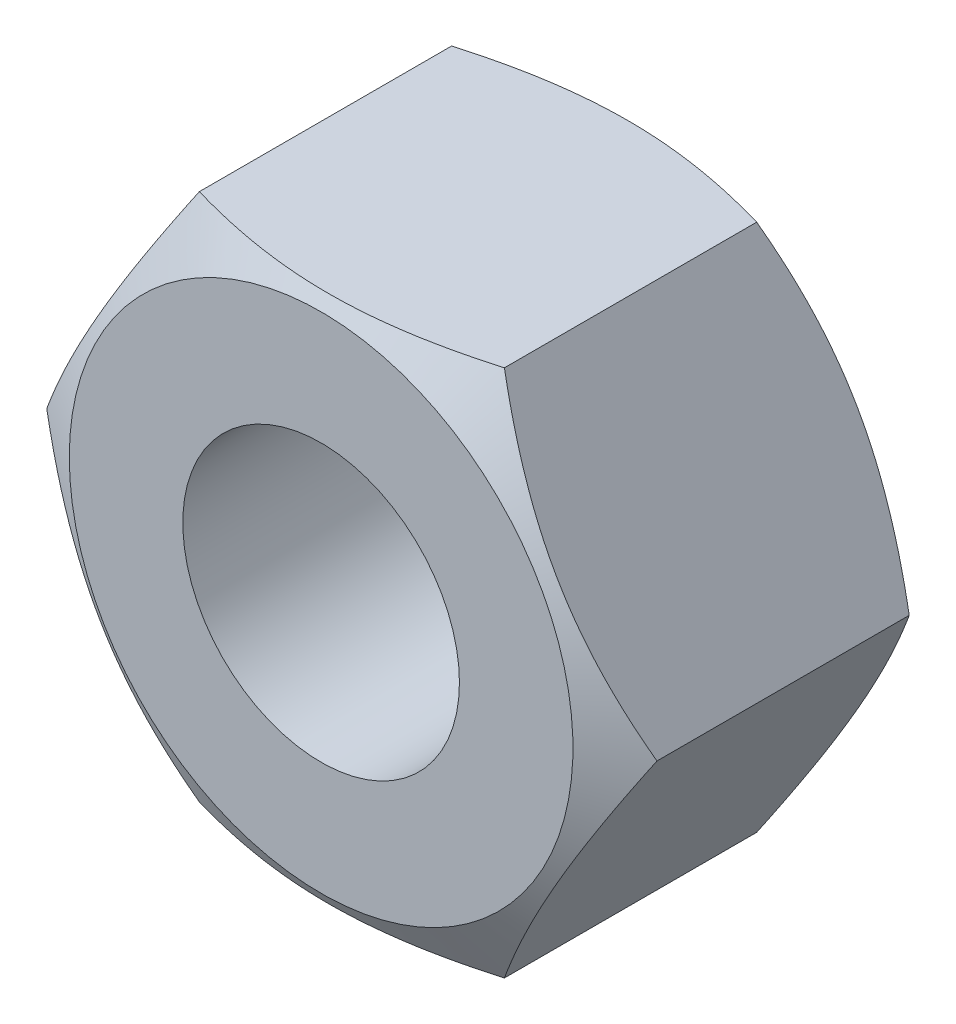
from build123d import *

# Parameters (mm, degrees)
SKETCH1_R     = 4.188
BASENUT_DEPTH = 9.5


with BuildPart() as part:
    # Sketch1 → BaseNut (new body)
    with BuildSketch(Plane.XY):
        Polygon((4.618802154, -8), (9.237604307, 0), (4.618802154, 8), (-4.618802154, 8), (-9.237604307, 0), (-4.618802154, -8), align=None)
        Circle(SKETCH1_R, mode=Mode.SUBTRACT)
    extrude(amount=-BASENUT_DEPTH)

    # Sketch2 → Double-Chamfer (revolve, cut)
    with BuildSketch(Plane(origin=(0, 0, 0), x_dir=(1, 0, 0), z_dir=(0, 1, 0))):
        Polygon((-9.237604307, 9.5), (-7.625, 9.5), (-9.237604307, 8.568962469), align=None)
        Polygon((-9.237604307, 0.931037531), (-9.237604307, 0), (-7.625, 0), align=None)
    revolve(axis=Axis((0, 0, -3.375940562), (0, 0, 1)), mode=Mode.SUBTRACT)


solid = part.part
